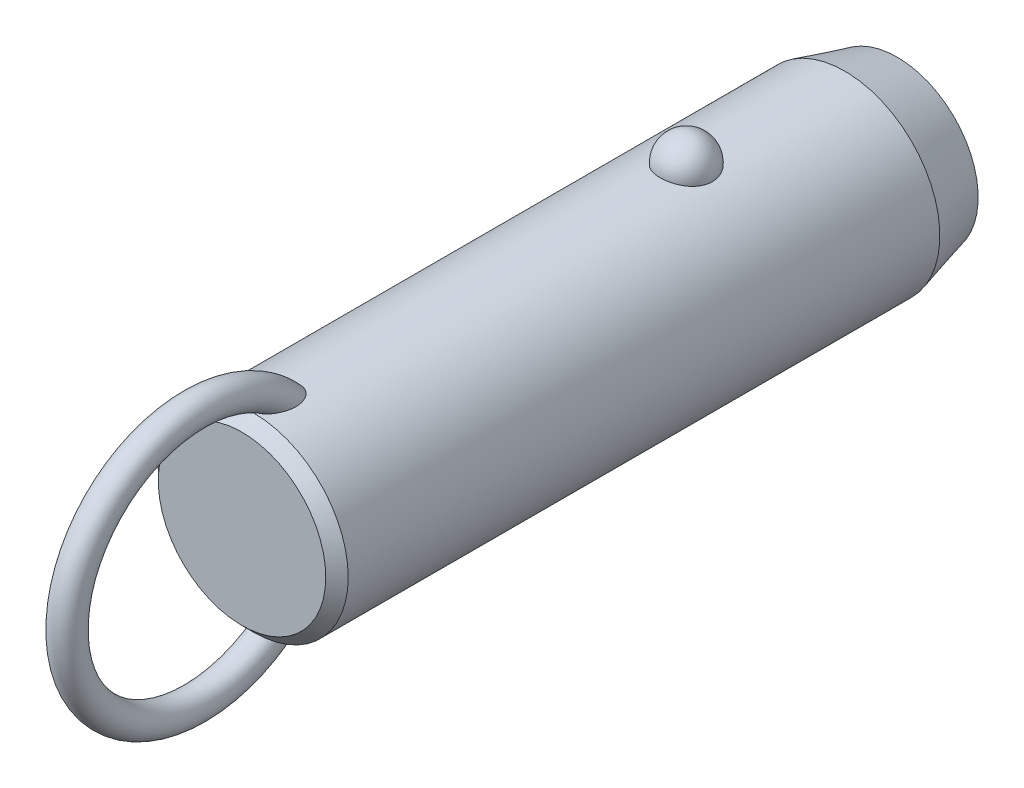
ISO-10303-21;
HEADER;
FILE_DESCRIPTION(('STEP AP214'),'2;1');
FILE_NAME('part.step','',(''),(''),'','','');
FILE_SCHEMA(('AUTOMOTIVE_DESIGN { 1 0 10303 214 1 1 1 1 }'));
ENDSEC;
DATA;
#1=APPLICATION_CONTEXT('core data for automotive mechanical design processes');
#2=APPLICATION_PROTOCOL_DEFINITION('international standard','automotive_design',2000,#1);
#3=PRODUCT_CONTEXT('',#1,'mechanical');
#4=PRODUCT('Part','Part','',(#3));
#5=PRODUCT_RELATED_PRODUCT_CATEGORY('part','',(#4));
#6=PRODUCT_DEFINITION_FORMATION('','',#4);
#7=PRODUCT_DEFINITION_CONTEXT('part definition',#1,'design');
#8=PRODUCT_DEFINITION('design','',#6,#7);
#9=PRODUCT_DEFINITION_SHAPE('','',#8);
#10=(LENGTH_UNIT() NAMED_UNIT(*) SI_UNIT(.MILLI.,.METRE.));
#11=(NAMED_UNIT(*) PLANE_ANGLE_UNIT() SI_UNIT($,.RADIAN.));
#12=(NAMED_UNIT(*) SI_UNIT($,.STERADIAN.) SOLID_ANGLE_UNIT());
#13=UNCERTAINTY_MEASURE_WITH_UNIT(LENGTH_MEASURE(1.E-05),#10,'distance_accuracy_value','');
#14=(GEOMETRIC_REPRESENTATION_CONTEXT(3) GLOBAL_UNCERTAINTY_ASSIGNED_CONTEXT((#13)) GLOBAL_UNIT_ASSIGNED_CONTEXT((#10,
#11,#12)) REPRESENTATION_CONTEXT('',''));
#15=CARTESIAN_POINT('',(0.,0.,0.));
#16=DIRECTION('',(0.,0.,1.));
#17=DIRECTION('',(1.,0.,0.));
#18=AXIS2_PLACEMENT_3D('',#15,#16,#17);
#19=CARTESIAN_POINT('',(0.,0.,43.2));
#20=DIRECTION('',(0.,0.,-1.));
#21=DIRECTION('',(-1.,0.,0.));
#22=AXIS2_PLACEMENT_3D('',#19,#20,#21);
#23=CYLINDRICAL_SURFACE('',#22,12.7);
#24=CARTESIAN_POINT('',(3.46661256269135,12.2177165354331,-3.5));
#25=CARTESIAN_POINT('',(3.4666090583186,12.2177194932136,-3.30432790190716));
#26=CARTESIAN_POINT('',(3.45063567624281,12.2222841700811,-3.10861112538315));
#27=CARTESIAN_POINT('',(3.38712451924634,12.2400345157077,-2.72271899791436));
#28=CARTESIAN_POINT('',(3.33957415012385,12.2532236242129,-2.53254588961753));
#29=CARTESIAN_POINT('',(3.2141234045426,12.286724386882,-2.16324948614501));
#30=CARTESIAN_POINT('',(3.13623639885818,12.3070329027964,-1.98412136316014));
#31=CARTESIAN_POINT('',(2.95205930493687,12.3525018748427,-1.64180592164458));
#32=CARTESIAN_POINT('',(2.84577003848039,12.3776621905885,-1.47861814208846));
#33=CARTESIAN_POINT('',(2.60688050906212,12.4301712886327,-1.17190583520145));
#34=CARTESIAN_POINT('',(2.47415697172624,12.4575299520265,-1.02847897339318));
#35=CARTESIAN_POINT('',(2.18615174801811,12.5112810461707,-0.766177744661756));
#36=CARTESIAN_POINT('',(2.03087002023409,12.5376734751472,-0.647303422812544));
#37=CARTESIAN_POINT('',(1.70237334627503,12.5864761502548,-0.437732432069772));
#38=CARTESIAN_POINT('',(1.52920948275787,12.6088972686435,-0.346958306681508));
#39=CARTESIAN_POINT('',(1.16944170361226,12.6473352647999,-0.195750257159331));
#40=CARTESIAN_POINT('',(0.982839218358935,12.663352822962,-0.135313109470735));
#41=CARTESIAN_POINT('',(0.604961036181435,12.6869706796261,-0.0473241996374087));
#42=CARTESIAN_POINT('',(0.413823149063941,12.6947125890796,-0.0192185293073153));
#43=CARTESIAN_POINT('',(0.0293827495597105,12.7014203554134,0.0051725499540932));
#44=CARTESIAN_POINT('',(-0.163919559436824,12.7003870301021,0.00146092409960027));
#45=CARTESIAN_POINT('',(-0.544374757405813,12.689735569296,-0.0373939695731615));
#46=CARTESIAN_POINT('',(-0.731575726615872,12.6802364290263,-0.0721015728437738));
#47=CARTESIAN_POINT('',(-1.09733277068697,12.6538333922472,-0.171364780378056));
#48=CARTESIAN_POINT('',(-1.27588869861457,12.6369293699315,-0.235920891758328));
#49=CARTESIAN_POINT('',(-1.6204698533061,12.5973946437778,-0.393548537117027));
#50=CARTESIAN_POINT('',(-1.78641865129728,12.5747321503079,-0.486778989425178));
#51=CARTESIAN_POINT('',(-2.10030671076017,12.5261316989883,-0.699110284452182));
#52=CARTESIAN_POINT('',(-2.24824419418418,12.5001934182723,-0.818213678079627));
#53=CARTESIAN_POINT('',(-2.52491489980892,12.4472906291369,-1.08157124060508));
#54=CARTESIAN_POINT('',(-2.65324222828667,12.4203160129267,-1.22624992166));
#55=CARTESIAN_POINT('',(-2.88410007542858,12.3687509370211,-1.53528325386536));
#56=CARTESIAN_POINT('',(-2.98662883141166,12.3441606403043,-1.69963924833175));
#57=CARTESIAN_POINT('',(-3.16432417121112,12.2998199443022,-2.04548497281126));
#58=CARTESIAN_POINT('',(-3.23917525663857,12.2801261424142,-2.22714424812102));
#59=CARTESIAN_POINT('',(-3.35800573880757,12.248167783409,-2.6009138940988));
#60=CARTESIAN_POINT('',(-3.4019860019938,12.2359030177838,-2.79302397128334));
#61=CARTESIAN_POINT('',(-3.45784812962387,12.2202347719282,-3.18140279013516));
#62=CARTESIAN_POINT('',(-3.46986123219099,12.2167950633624,-3.37765118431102));
#63=CARTESIAN_POINT('',(-3.46186273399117,12.2190638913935,-3.76943689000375));
#64=CARTESIAN_POINT('',(-3.44185196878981,12.2247721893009,-3.96497421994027));
#65=CARTESIAN_POINT('',(-3.37048652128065,12.2446381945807,-4.34881728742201));
#66=CARTESIAN_POINT('',(-3.31928253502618,12.2587552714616,-4.53715319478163));
#67=CARTESIAN_POINT('',(-3.18693461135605,12.2938237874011,-4.90231727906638));
#68=CARTESIAN_POINT('',(-3.1057895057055,12.3147754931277,-5.07914500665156));
#69=CARTESIAN_POINT('',(-2.91506431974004,12.3613125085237,-5.4173205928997));
#70=CARTESIAN_POINT('',(-2.80533587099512,12.3869217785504,-5.57858147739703));
#71=CARTESIAN_POINT('',(-2.560414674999,12.4398525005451,-5.88013283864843));
#72=CARTESIAN_POINT('',(-2.42522099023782,12.4671740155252,-6.02042254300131));
#73=CARTESIAN_POINT('',(-2.1323357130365,12.5205965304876,-6.27662798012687));
#74=CARTESIAN_POINT('',(-1.97456596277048,12.5466928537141,-6.39245542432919));
#75=CARTESIAN_POINT('',(-1.64115839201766,12.5946384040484,-6.59583547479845));
#76=CARTESIAN_POINT('',(-1.46552179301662,12.6164879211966,-6.68339001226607));
#77=CARTESIAN_POINT('',(-1.10356050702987,12.6532533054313,-6.82682153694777));
#78=CARTESIAN_POINT('',(-0.917391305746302,12.6682500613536,-6.88306988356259));
#79=CARTESIAN_POINT('',(-0.537836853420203,12.6900288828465,-6.96386887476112));
#80=CARTESIAN_POINT('',(-0.344452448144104,12.6968119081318,-6.98842322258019));
#81=CARTESIAN_POINT('',(0.0402577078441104,12.7013667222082,-7.0049646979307));
#82=CARTESIAN_POINT('',(0.231556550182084,12.6993008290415,-6.99753844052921));
#83=CARTESIAN_POINT('',(0.610105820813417,12.6867505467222,-6.95166366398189));
#84=CARTESIAN_POINT('',(0.797356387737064,12.6762664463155,-6.91321620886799));
#85=CARTESIAN_POINT('',(1.16186657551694,12.6480587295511,-6.80658431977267));
#86=CARTESIAN_POINT('',(1.33915951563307,12.6303611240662,-6.73850666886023));
#87=CARTESIAN_POINT('',(1.67968518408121,12.5896027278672,-6.57450875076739));
#88=CARTESIAN_POINT('',(1.84291705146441,12.5665416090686,-6.47858678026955));
#89=CARTESIAN_POINT('',(2.15340192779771,12.5171072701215,-6.25982455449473));
#90=CARTESIAN_POINT('',(2.30037831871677,12.4906895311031,-6.13660186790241));
#91=CARTESIAN_POINT('',(2.5717412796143,12.4376567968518,-5.86739587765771));
#92=CARTESIAN_POINT('',(2.69612388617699,12.4110417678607,-5.72140858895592));
#93=CARTESIAN_POINT('',(2.92107785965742,12.360051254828,-5.40794137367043));
#94=CARTESIAN_POINT('',(3.02121329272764,12.3357209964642,-5.24014110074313));
#95=CARTESIAN_POINT('',(3.19236291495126,12.2925446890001,-4.8896986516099));
#96=CARTESIAN_POINT('',(3.26338839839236,12.2736965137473,-4.70706226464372));
#97=CARTESIAN_POINT('',(3.36788038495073,12.245404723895,-4.35469510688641));
#98=CARTESIAN_POINT('',(3.40484026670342,12.2351018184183,-4.18605935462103));
#99=CARTESIAN_POINT('',(3.45420764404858,12.2212564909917,-3.84496058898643));
#100=CARTESIAN_POINT('',(3.46661565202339,12.2177139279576,-3.67249765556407));
#101=CARTESIAN_POINT('',(3.46661256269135,12.2177165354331,-3.5));
#102=B_SPLINE_CURVE_WITH_KNOTS('',3,(#24,#25,#26,#27,#28,#29,#30,#31,#32,#33,#34,#35,#36,#37,
#38,#39,#40,#41,#42,#43,#44,#45,#46,#47,#48,#49,#50,#51,#52,#53,#54,#55,#56,#57,#58,#59,#60,#61,
#62,#63,#64,#65,#66,#67,#68,#69,#70,#71,#72,#73,#74,#75,#76,#77,#78,#79,#80,#81,#82,#83,#84,#85,
#86,#87,#88,#89,#90,#91,#92,#93,#94,#95,#96,#97,#98,#99,#100,#101),.UNSPECIFIED.,.T.,.F.,(4,2,2,
2,2,2,2,2,2,2,2,2,2,2,2,2,2,2,2,2,2,2,2,2,2,2,2,2,2,2,2,2,2,2,2,2,2,2,4),(0.,0.586396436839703,
1.17302689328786,1.7593990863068,2.34575431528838,2.93491084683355,3.52406845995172,
4.11158733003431,4.69904375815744,5.2762784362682,5.85345931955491,6.42265312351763,
6.99185659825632,7.56427334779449,8.136746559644,8.71981013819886,9.3029135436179,
9.89247258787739,10.4820150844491,11.0691335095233,11.6562366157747,12.2405256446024,
12.8248374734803,13.412244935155,13.9996740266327,14.5891883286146,15.1786623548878,
15.7609861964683,16.3432419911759,16.914863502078,17.4864654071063,18.0560241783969,
18.6256177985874,19.2037609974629,19.7820055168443,20.3699810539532,20.9577282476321,
21.4746855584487,21.9916320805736),.UNSPECIFIED.);
#103=CARTESIAN_POINT('',(3.46661256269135,12.2177165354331,-3.5));
#104=VERTEX_POINT('',#103);
#105=EDGE_CURVE('E41',#104,#104,#102,.T.);
#106=ORIENTED_EDGE('',*,*,#105,.T.);
#107=EDGE_LOOP('',(#106));
#108=FACE_BOUND('',#107,.T.);
#109=CARTESIAN_POINT('',(0.,0.,54.4));
#110=DIRECTION('',(0.,0.,1.));
#111=DIRECTION('',(1.,0.,0.));
#112=AXIS2_PLACEMENT_3D('',#109,#110,#111);
#113=CIRCLE('',#112,12.7);
#114=CARTESIAN_POINT('',(12.7,0.,54.4));
#115=VERTEX_POINT('',#114);
#116=EDGE_CURVE('E10',#115,#115,#113,.F.);
#117=ORIENTED_EDGE('',*,*,#116,.T.);
#118=EDGE_LOOP('',(#117));
#119=FACE_BOUND('',#118,.T.);
#120=CARTESIAN_POINT('',(-0.548122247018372,-12.6881662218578,48.1432187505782));
#121=CARTESIAN_POINT('',(-0.648865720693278,-12.6838128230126,48.177926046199));
#122=CARTESIAN_POINT('',(-0.746398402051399,-12.6783867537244,48.2220428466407));
#123=CARTESIAN_POINT('',(-0.932125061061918,-12.666091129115,48.3267647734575));
#124=CARTESIAN_POINT('',(-1.02030388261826,-12.6592192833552,48.387396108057));
#125=CARTESIAN_POINT('',(-1.18487740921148,-12.6448747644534,48.521847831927));
#126=CARTESIAN_POINT('',(-1.26134296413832,-12.637406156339,48.5955825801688));
#127=CARTESIAN_POINT('',(-1.4023120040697,-12.6225412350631,48.7536045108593));
#128=CARTESIAN_POINT('',(-1.46681470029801,-12.6151449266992,48.8378923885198));
#129=CARTESIAN_POINT('',(-1.60714786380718,-12.5981718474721,49.0496577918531));
#130=CARTESIAN_POINT('',(-1.67725126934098,-12.588900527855,49.180962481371));
#131=CARTESIAN_POINT('',(-1.79536591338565,-12.5725964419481,49.4532471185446));
#132=CARTESIAN_POINT('',(-1.84333535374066,-12.5655679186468,49.5942447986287));
#133=CARTESIAN_POINT('',(-1.93422576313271,-12.5519624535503,49.9376455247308));
#134=CARTESIAN_POINT('',(-1.96788773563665,-12.5466298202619,50.1425578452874));
#135=CARTESIAN_POINT('',(-1.9941399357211,-12.542463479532,50.4517600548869));
#136=CARTESIAN_POINT('',(-1.99883864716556,-12.5417153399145,50.5552987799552));
#137=CARTESIAN_POINT('',(-2.00078003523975,-12.5414074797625,50.7624512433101));
#138=CARTESIAN_POINT('',(-1.99802449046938,-12.5418474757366,50.8660649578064));
#139=CARTESIAN_POINT('',(-1.98336733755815,-12.5441750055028,51.1103207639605));
#140=CARTESIAN_POINT('',(-1.96851430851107,-12.5465291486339,51.2507804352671));
#141=CARTESIAN_POINT('',(-1.92707089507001,-12.5529612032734,51.5299607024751));
#142=CARTESIAN_POINT('',(-1.90047458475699,-12.5570399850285,51.6686803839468));
#143=CARTESIAN_POINT('',(-1.83619120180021,-12.5666008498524,51.9434113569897));
#144=CARTESIAN_POINT('',(-1.79850828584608,-12.57208240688,52.0794236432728));
#145=CARTESIAN_POINT('',(-1.71223796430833,-12.5841228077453,52.3478421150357));
#146=CARTESIAN_POINT('',(-1.66365679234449,-12.5906810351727,52.4802503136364));
#147=CARTESIAN_POINT('',(-1.57804503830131,-12.6016176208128,52.6854887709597));
#148=CARTESIAN_POINT('',(-1.54477252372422,-12.6057501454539,52.7599149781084));
#149=CARTESIAN_POINT('',(-1.47424480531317,-12.6141930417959,52.9068393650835));
#150=CARTESIAN_POINT('',(-1.43699041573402,-12.6185033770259,52.9793379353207));
#151=CARTESIAN_POINT('',(-1.35825795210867,-12.6272207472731,53.1218926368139));
#152=CARTESIAN_POINT('',(-1.31678520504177,-12.6316276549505,53.1919517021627));
#153=CARTESIAN_POINT('',(-1.22917793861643,-12.6404532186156,53.3290705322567));
#154=CARTESIAN_POINT('',(-1.18304514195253,-12.6448718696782,53.3961313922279));
#155=CARTESIAN_POINT('',(-1.0724641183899,-12.6547893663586,53.5438741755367));
#156=CARTESIAN_POINT('',(-1.00642239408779,-12.6602600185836,53.6233844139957));
#157=CARTESIAN_POINT('',(-0.86444142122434,-12.6707460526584,53.7731698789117));
#158=CARTESIAN_POINT('',(-0.788516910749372,-12.6757620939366,53.8434585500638));
#159=CARTESIAN_POINT('',(-0.652215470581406,-12.6833591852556,53.9486801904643));
#160=CARTESIAN_POINT('',(-0.594982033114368,-12.6861973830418,53.9876241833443));
#161=CARTESIAN_POINT('',(-0.475269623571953,-12.6912445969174,54.0564899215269));
#162=CARTESIAN_POINT('',(-0.412800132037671,-12.6934547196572,54.0864275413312));
#163=CARTESIAN_POINT('',(-0.29574972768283,-12.6966636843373,54.1297565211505));
#164=CARTESIAN_POINT('',(-0.241949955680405,-12.6978134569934,54.1452188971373));
#165=CARTESIAN_POINT('',(-0.132508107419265,-12.6994261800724,54.1668845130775));
#166=CARTESIAN_POINT('',(-0.0768679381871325,-12.6998898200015,54.1730970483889));
#167=CARTESIAN_POINT('',(0.0347696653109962,-12.7000752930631,54.1755838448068));
#168=CARTESIAN_POINT('',(0.0907676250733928,-12.6997954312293,54.1718353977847));
#169=CARTESIAN_POINT('',(0.201283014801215,-12.6985255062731,54.1547883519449));
#170=CARTESIAN_POINT('',(0.255799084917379,-12.6975348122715,54.1414812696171));
#171=CARTESIAN_POINT('',(0.376042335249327,-12.6946091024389,54.1020379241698));
#172=CARTESIAN_POINT('',(0.440950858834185,-12.6924943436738,54.0734492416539));
#173=CARTESIAN_POINT('',(0.565350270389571,-12.6875639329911,54.0063234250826));
#174=CARTESIAN_POINT('',(0.624828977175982,-12.6847467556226,53.9677646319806));
#175=CARTESIAN_POINT('',(0.774116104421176,-12.6767252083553,53.856949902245));
#176=CARTESIAN_POINT('',(0.859449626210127,-12.6711344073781,53.7787605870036));
#177=CARTESIAN_POINT('',(1.01789440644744,-12.6593922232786,53.610943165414));
#178=CARTESIAN_POINT('',(1.09096902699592,-12.653239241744,53.521282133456));
#179=CARTESIAN_POINT('',(1.22268793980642,-12.6411674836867,53.3402658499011));
#180=CARTESIAN_POINT('',(1.28193986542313,-12.6352572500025,53.249345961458));
#181=CARTESIAN_POINT('',(1.39259777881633,-12.6235401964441,53.0627929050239));
#182=CARTESIAN_POINT('',(1.44399707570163,-12.6177334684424,52.9671558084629));
#183=CARTESIAN_POINT('',(1.53972870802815,-12.6064093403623,52.7722738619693));
#184=CARTESIAN_POINT('',(1.58405262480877,-12.6008922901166,52.6730248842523));
#185=CARTESIAN_POINT('',(1.66600705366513,-12.5903187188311,52.4717727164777));
#186=CARTESIAN_POINT('',(1.70363651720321,-12.5852622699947,52.3697690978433));
#187=CARTESIAN_POINT('',(1.77545379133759,-12.5753406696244,52.1543580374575));
#188=CARTESIAN_POINT('',(1.80903453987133,-12.5705328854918,52.040745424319));
#189=CARTESIAN_POINT('',(1.86844163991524,-12.5618400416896,51.8114575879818));
#190=CARTESIAN_POINT('',(1.89426665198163,-12.5579551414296,51.6957820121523));
#191=CARTESIAN_POINT('',(1.9378546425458,-12.5513030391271,51.4630072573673));
#192=CARTESIAN_POINT('',(1.9556264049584,-12.5485346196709,51.3459097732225));
#193=CARTESIAN_POINT('',(1.98264463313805,-12.5442934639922,51.1107473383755));
#194=CARTESIAN_POINT('',(1.99189298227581,-12.5428204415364,50.9926826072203));
#195=CARTESIAN_POINT('',(2.00416068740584,-12.540871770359,50.6806225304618));
#196=CARTESIAN_POINT('',(1.99944433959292,-12.541631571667,50.4862290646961));
#197=CARTESIAN_POINT('',(1.96113755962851,-12.5476846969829,50.1003095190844));
#198=CARTESIAN_POINT('',(1.92758341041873,-12.5529723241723,49.9087801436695));
#199=CARTESIAN_POINT('',(1.8393434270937,-12.5661532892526,49.5822728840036));
#200=CARTESIAN_POINT('',(1.79215440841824,-12.5730485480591,49.4452499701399));
#201=CARTESIAN_POINT('',(1.67676242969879,-12.588958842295,49.1804459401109));
#202=CARTESIAN_POINT('',(1.60859050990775,-12.597970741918,49.0526515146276));
#203=CARTESIAN_POINT('',(1.46583832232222,-12.6152829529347,48.8358006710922));
#204=CARTESIAN_POINT('',(1.39525727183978,-12.6233659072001,48.7441050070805));
#205=CARTESIAN_POINT('',(1.23992594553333,-12.6395676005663,48.5734854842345));
#206=CARTESIAN_POINT('',(1.15517932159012,-12.6476863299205,48.4945583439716));
#207=CARTESIAN_POINT('',(0.971995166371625,-12.6630846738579,48.3526438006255));
#208=CARTESIAN_POINT('',(0.873456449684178,-12.6703572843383,48.2897849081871));
#209=CARTESIAN_POINT('',(0.665847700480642,-12.6829569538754,48.1844870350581));
#210=CARTESIAN_POINT('',(0.556784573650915,-12.688285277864,48.1420347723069));
#211=CARTESIAN_POINT('',(0.347338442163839,-12.6956226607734,48.0844434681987));
#212=CARTESIAN_POINT('',(0.247759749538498,-12.6979816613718,48.0663996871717));
#213=CARTESIAN_POINT('',(0.0470218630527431,-12.7003077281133,48.0486007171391));
#214=CARTESIAN_POINT('',(-0.0541350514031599,-12.7002779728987,48.0488212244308));
#215=CARTESIAN_POINT('',(-0.221414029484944,-12.6982482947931,48.0643639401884));
#216=CARTESIAN_POINT('',(-0.288055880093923,-12.6969033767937,48.0746662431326));
#217=CARTESIAN_POINT('',(-0.419599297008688,-12.6932369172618,48.1031348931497));
#218=CARTESIAN_POINT('',(-0.484501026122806,-12.6909154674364,48.1213005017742));
#219=CARTESIAN_POINT('',(-0.548122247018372,-12.6881662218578,48.1432187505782));
#220=B_SPLINE_CURVE_WITH_KNOTS('',3,(#120,#121,#122,#123,#124,#125,#126,#127,#128,#129,#130,
#131,#132,#133,#134,#135,#136,#137,#138,#139,#140,#141,#142,#143,#144,#145,#146,#147,#148,#149,
#150,#151,#152,#153,#154,#155,#156,#157,#158,#159,#160,#161,#162,#163,#164,#165,#166,#167,#168,
#169,#170,#171,#172,#173,#174,#175,#176,#177,#178,#179,#180,#181,#182,#183,#184,#185,#186,#187,
#188,#189,#190,#191,#192,#193,#194,#195,#196,#197,#198,#199,#200,#201,#202,#203,#204,#205,#206,
#207,#208,#209,#210,#211,#212,#213,#214,#215,#216,#217,#218,#219),.UNSPECIFIED.,.T.,.F.,(4,2,2,
2,2,2,2,2,2,2,2,2,2,2,2,2,2,2,2,2,2,2,2,2,2,2,2,2,2,2,2,2,2,2,2,2,2,2,2,2,2,2,2,2,2,2,2,2,2,4),
(0.,0.319642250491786,0.63979475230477,0.957927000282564,1.27608021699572,1.72100165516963,
2.16675988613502,2.78630021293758,3.09705782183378,3.40774128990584,3.83096358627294,
4.2543996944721,4.67767724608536,5.10071330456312,5.34550297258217,5.59024267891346,
5.83467707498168,6.07902143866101,6.38891080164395,6.69834321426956,6.90560910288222,
7.11250749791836,7.27977315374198,7.44687060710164,7.61434932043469,7.78197685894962,
7.99365544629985,8.20579780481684,8.55147335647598,8.8981642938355,9.22375138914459,
9.54961437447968,9.87586224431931,10.202161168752,10.557587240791,10.9130746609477,
11.2681734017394,11.6231936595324,12.2046601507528,12.7853961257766,13.219164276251,
13.6522938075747,13.9989174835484,14.3454519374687,14.6946768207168,15.0436740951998,
15.3457513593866,15.6474266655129,15.8493051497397,16.0511646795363),.UNSPECIFIED.);
#221=CARTESIAN_POINT('',(-0.548122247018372,-12.6881662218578,48.1432187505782));
#222=VERTEX_POINT('',#221);
#223=EDGE_CURVE('E60',#222,#222,#220,.T.);
#224=ORIENTED_EDGE('',*,*,#223,.T.);
#225=EDGE_LOOP('',(#224));
#226=FACE_BOUND('',#225,.T.);
#227=CARTESIAN_POINT('',(-0.548122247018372,12.6881662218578,48.1432187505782));
#228=CARTESIAN_POINT('',(-0.459436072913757,12.6919968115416,48.112673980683));
#229=CARTESIAN_POINT('',(-0.368189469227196,12.6949996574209,48.0893913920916));
#230=CARTESIAN_POINT('',(-0.183024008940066,12.6990186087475,48.0584062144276));
#231=CARTESIAN_POINT('',(-0.089104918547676,12.7000345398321,48.0507049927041));
#232=CARTESIAN_POINT('',(0.0987147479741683,12.6999636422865,48.0512455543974));
#233=CARTESIAN_POINT('',(0.192615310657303,12.6988761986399,48.0594920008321));
#234=CARTESIAN_POINT('',(0.377658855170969,12.6947211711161,48.0915515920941));
#235=CARTESIAN_POINT('',(0.46880177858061,12.6916535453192,48.1153650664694));
#236=CARTESIAN_POINT('',(0.645809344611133,12.6838788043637,48.1774565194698));
#237=CARTESIAN_POINT('',(0.731679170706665,12.6791733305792,48.215720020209));
#238=CARTESIAN_POINT('',(0.896315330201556,12.6686004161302,48.305120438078));
#239=CARTESIAN_POINT('',(0.975080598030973,12.6627328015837,48.3562592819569));
#240=CARTESIAN_POINT('',(1.12963655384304,12.6499161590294,48.4736782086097));
#241=CARTESIAN_POINT('',(1.20478673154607,12.6429194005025,48.5407929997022));
#242=CARTESIAN_POINT('',(1.34448241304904,12.6288282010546,48.6852250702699));
#243=CARTESIAN_POINT('',(1.40902173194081,12.621733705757,48.7625482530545));
#244=CARTESIAN_POINT('',(1.55208211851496,12.6050877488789,48.9592475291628));
#245=CARTESIAN_POINT('',(1.62510490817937,12.5957546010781,49.0826540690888));
#246=CARTESIAN_POINT('',(1.7501904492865,12.5789823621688,49.3397690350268));
#247=CARTESIAN_POINT('',(1.80221377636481,12.5715468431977,49.473496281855));
#248=CARTESIAN_POINT('',(1.90309965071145,12.5567434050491,49.7983516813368));
#249=CARTESIAN_POINT('',(1.94342317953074,12.5504515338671,49.9921611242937));
#250=CARTESIAN_POINT('',(1.99332997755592,12.5426147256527,50.3837881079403));
#251=CARTESIAN_POINT('',(2.00285305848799,12.5410790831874,50.5816127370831));
#252=CARTESIAN_POINT('',(1.99678999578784,12.5420407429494,50.9166427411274));
#253=CARTESIAN_POINT('',(1.98794117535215,12.5434564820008,51.0540428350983));
#254=CARTESIAN_POINT('',(1.95865119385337,12.5480641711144,51.3276394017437));
#255=CARTESIAN_POINT('',(1.93820436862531,12.5512569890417,51.4638352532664));
#256=CARTESIAN_POINT('',(1.88647896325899,12.5591352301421,51.7342493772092));
#257=CARTESIAN_POINT('',(1.85518800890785,12.5638223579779,51.8684652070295));
#258=CARTESIAN_POINT('',(1.78217886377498,12.5743868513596,52.1339362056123));
#259=CARTESIAN_POINT('',(1.74046509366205,12.5802637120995,52.2651926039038));
#260=CARTESIAN_POINT('',(1.66024095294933,12.5910571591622,52.4860855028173));
#261=CARTESIAN_POINT('',(1.62434772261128,12.5957535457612,52.5766904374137));
#262=CARTESIAN_POINT('',(1.54709009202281,12.6054762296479,52.7555125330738));
#263=CARTESIAN_POINT('',(1.50572681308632,12.6105024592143,52.8437301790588));
#264=CARTESIAN_POINT('',(1.41728020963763,12.620748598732,53.0169321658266));
#265=CARTESIAN_POINT('',(1.37021377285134,12.625967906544,53.1019251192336));
#266=CARTESIAN_POINT('',(1.26969620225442,12.6364721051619,53.2680072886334));
#267=CARTESIAN_POINT('',(1.21624929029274,12.6417569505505,53.3490990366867));
#268=CARTESIAN_POINT('',(1.10304413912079,12.6521331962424,53.5047027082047));
#269=CARTESIAN_POINT('',(1.04340936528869,12.657226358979,53.5793033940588));
#270=CARTESIAN_POINT('',(0.915919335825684,12.6670906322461,53.721324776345));
#271=CARTESIAN_POINT('',(0.848064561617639,12.6718617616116,53.7887458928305));
#272=CARTESIAN_POINT('',(0.717035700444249,12.67987711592,53.9006247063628));
#273=CARTESIAN_POINT('',(0.655526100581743,12.6832377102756,53.9469970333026));
#274=CARTESIAN_POINT('',(0.525985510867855,12.6892676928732,54.0296195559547));
#275=CARTESIAN_POINT('',(0.457969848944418,12.6919386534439,54.0658927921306));
#276=CARTESIAN_POINT('',(0.334859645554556,12.695691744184,54.1166572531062));
#277=CARTESIAN_POINT('',(0.281116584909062,12.6970073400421,54.1343733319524));
#278=CARTESIAN_POINT('',(0.171425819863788,12.6989609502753,54.1606429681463));
#279=CARTESIAN_POINT('',(0.115480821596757,12.699599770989,54.1692074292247));
#280=CARTESIAN_POINT('',(0.00272618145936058,12.7001251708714,54.1762531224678));
#281=CARTESIAN_POINT('',(-0.0540859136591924,12.7000089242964,54.1746964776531));
#282=CARTESIAN_POINT('',(-0.166544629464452,12.6990328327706,54.1616005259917));
#283=CARTESIAN_POINT('',(-0.222190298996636,12.6981724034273,54.1500533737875));
#284=CARTESIAN_POINT('',(-0.342018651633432,12.695562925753,54.1149128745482));
#285=CARTESIAN_POINT('',(-0.405606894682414,12.6936676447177,54.0893322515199));
#286=CARTESIAN_POINT('',(-0.527815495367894,12.6891754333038,54.0283111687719));
#287=CARTESIAN_POINT('',(-0.586425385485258,12.6865770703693,53.9928505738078));
#288=CARTESIAN_POINT('',(-0.731842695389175,12.6792129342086,53.8914960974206));
#289=CARTESIAN_POINT('',(-0.814709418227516,12.6740767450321,53.8200395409));
#290=CARTESIAN_POINT('',(-0.969101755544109,12.6632083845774,53.6658900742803));
#291=CARTESIAN_POINT('',(-1.04059564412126,12.6574746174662,53.5831668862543));
#292=CARTESIAN_POINT('',(-1.1698111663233,12.6461638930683,53.4158096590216));
#293=CARTESIAN_POINT('',(-1.22811369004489,12.6405994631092,53.3316166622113));
#294=CARTESIAN_POINT('',(-1.33743405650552,12.6295007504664,53.1585791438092));
#295=CARTESIAN_POINT('',(-1.38844577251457,12.6239664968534,53.0697307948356));
#296=CARTESIAN_POINT('',(-1.48400702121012,12.6130898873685,52.888389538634));
#297=CARTESIAN_POINT('',(-1.52854232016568,12.6077479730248,52.7958891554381));
#298=CARTESIAN_POINT('',(-1.61150113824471,12.5974127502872,52.6081607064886));
#299=CARTESIAN_POINT('',(-1.64992317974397,12.5924195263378,52.5129319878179));
#300=CARTESIAN_POINT('',(-1.73468589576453,12.581070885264,52.2828936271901));
#301=CARTESIAN_POINT('',(-1.77831261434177,12.5749388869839,52.1470661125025));
#302=CARTESIAN_POINT('',(-1.85439734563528,12.5639437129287,51.8722128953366));
#303=CARTESIAN_POINT('',(-1.88684994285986,12.5590811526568,51.7331856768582));
#304=CARTESIAN_POINT('',(-1.9400848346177,12.550968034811,51.4530923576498));
#305=CARTESIAN_POINT('',(-1.96088706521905,12.5477147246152,51.3120301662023));
#306=CARTESIAN_POINT('',(-1.99000539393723,12.5431291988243,51.0286689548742));
#307=CARTESIAN_POINT('',(-1.99832911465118,12.5417958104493,50.8863707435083));
#308=CARTESIAN_POINT('',(-2.00166624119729,12.5412674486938,50.5576271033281));
#309=CARTESIAN_POINT('',(-1.99178843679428,12.5428579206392,50.371088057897));
#310=CARTESIAN_POINT('',(-1.9445518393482,12.5502731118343,50.0016240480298));
#311=CARTESIAN_POINT('',(-1.90724032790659,12.5560905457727,49.8186934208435));
#312=CARTESIAN_POINT('',(-1.81330718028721,12.5699462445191,49.5048488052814));
#313=CARTESIAN_POINT('',(-1.76338820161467,12.5771273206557,49.3719105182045));
#314=CARTESIAN_POINT('',(-1.64305018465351,12.593414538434,49.1156813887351));
#315=CARTESIAN_POINT('',(-1.57265346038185,12.6025185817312,48.992380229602));
#316=CARTESIAN_POINT('',(-1.42634956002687,12.6198178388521,48.7835648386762));
#317=CARTESIAN_POINT('',(-1.35423772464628,12.6278405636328,48.6953846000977));
#318=CARTESIAN_POINT('',(-1.19645664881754,12.6437632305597,48.5321079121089));
#319=CARTESIAN_POINT('',(-1.11080536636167,12.6516633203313,48.4569944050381));
#320=CARTESIAN_POINT('',(-0.947219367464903,12.6648319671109,48.3378114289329));
#321=CARTESIAN_POINT('',(-0.871624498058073,12.670300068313,48.2905414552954));
#322=CARTESIAN_POINT('',(-0.714161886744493,12.6801492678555,48.2077413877));
#323=CARTESIAN_POINT('',(-0.632295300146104,12.684530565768,48.1722091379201));
#324=CARTESIAN_POINT('',(-0.548122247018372,12.6881662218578,48.1432187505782));
#325=B_SPLINE_CURVE_WITH_KNOTS('',3,(#227,#228,#229,#230,#231,#232,#233,#234,#235,#236,#237,
#238,#239,#240,#241,#242,#243,#244,#245,#246,#247,#248,#249,#250,#251,#252,#253,#254,#255,#256,
#257,#258,#259,#260,#261,#262,#263,#264,#265,#266,#267,#268,#269,#270,#271,#272,#273,#274,#275,
#276,#277,#278,#279,#280,#281,#282,#283,#284,#285,#286,#287,#288,#289,#290,#291,#292,#293,#294,
#295,#296,#297,#298,#299,#300,#301,#302,#303,#304,#305,#306,#307,#308,#309,#310,#311,#312,#313,
#314,#315,#316,#317,#318,#319,#320,#321,#322,#323,#324),.UNSPECIFIED.,.T.,.F.,(4,2,2,2,2,2,2,2,
2,2,2,2,2,2,2,2,2,2,2,2,2,2,2,2,2,2,2,2,2,2,2,2,2,2,2,2,2,2,2,2,2,2,2,2,2,2,2,2,4),(0.,
0.281328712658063,0.56268211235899,0.844117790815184,1.12555942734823,1.40671982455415,
1.68792232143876,1.98972294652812,2.2916988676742,2.72039860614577,3.14989948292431,
3.74084916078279,4.3329529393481,4.74554109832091,5.15833092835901,5.57159335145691,
5.98468079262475,6.27722775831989,6.56971484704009,6.86135609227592,7.15280542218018,
7.43927407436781,7.7257259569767,7.9563586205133,8.18646071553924,8.35559393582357,
8.52452541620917,8.69408946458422,8.86378678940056,9.06834348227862,9.27332014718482,
9.60010414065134,9.92778432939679,10.2350252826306,10.5425229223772,10.8506864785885,
11.1589244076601,11.5867893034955,12.0148612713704,12.4421984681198,12.8692745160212,
13.4279365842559,13.9856380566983,14.4107062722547,14.8353130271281,15.1765567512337,
15.5173516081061,15.7844129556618,16.051425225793),.UNSPECIFIED.);
#326=CARTESIAN_POINT('',(-0.548122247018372,12.6881662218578,48.1432187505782));
#327=VERTEX_POINT('',#326);
#328=EDGE_CURVE('E68',#327,#327,#325,.T.);
#329=ORIENTED_EDGE('',*,*,#328,.T.);
#330=EDGE_LOOP('',(#329));
#331=FACE_BOUND('',#330,.T.);
#332=CARTESIAN_POINT('',(0.,0.,-24.7000000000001));
#333=DIRECTION('',(0.,0.,-1.));
#334=DIRECTION('',(-1.,0.,0.));
#335=AXIS2_PLACEMENT_3D('',#332,#333,#334);
#336=CIRCLE('',#335,12.7);
#337=CARTESIAN_POINT('',(-12.7,0.,-24.7000000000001));
#338=VERTEX_POINT('',#337);
#339=EDGE_CURVE('E57',#338,#338,#336,.F.);
#340=ORIENTED_EDGE('',*,*,#339,.T.);
#341=EDGE_LOOP('',(#340));
#342=FACE_BOUND('',#341,.T.);
#343=ADVANCED_FACE('F37',(#108,#119,#226,#331,#342),#23,.T.);
#344=CARTESIAN_POINT('',(0.,0.,-31.7));
#345=DIRECTION('',(0.,0.,-1.));
#346=DIRECTION('',(-1.,0.,0.));
#347=AXIS2_PLACEMENT_3D('',#344,#345,#346);
#348=PLANE('',#347);
#349=CARTESIAN_POINT('',(0.,0.,-31.7));
#350=DIRECTION('',(0.,0.,-1.));
#351=DIRECTION('',(-1.,0.,0.));
#352=AXIS2_PLACEMENT_3D('',#349,#350,#351);
#353=CIRCLE('',#352,10.8243556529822);
#354=CARTESIAN_POINT('',(-10.8243556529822,0.,-31.7));
#355=VERTEX_POINT('',#354);
#356=EDGE_CURVE('E67',#355,#355,#353,.T.);
#357=ORIENTED_EDGE('',*,*,#356,.T.);
#358=EDGE_LOOP('',(#357));
#359=FACE_BOUND('',#358,.T.);
#360=ADVANCED_FACE('F86',(#359),#348,.T.);
#361=CARTESIAN_POINT('',(0.,0.,-31.7));
#362=DIRECTION('',(0.,0.,1.));
#363=DIRECTION('',(1.,0.,0.));
#364=AXIS2_PLACEMENT_3D('',#361,#362,#363);
#365=CONICAL_SURFACE('',#364,10.8243556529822,0.261799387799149);
#366=ORIENTED_EDGE('',*,*,#339,.F.);
#367=EDGE_LOOP('',(#366));
#368=FACE_BOUND('',#367,.T.);
#369=ORIENTED_EDGE('',*,*,#356,.F.);
#370=EDGE_LOOP('',(#369));
#371=FACE_BOUND('',#370,.T.);
#372=ADVANCED_FACE('F84',(#368,#371),#365,.T.);
#373=CARTESIAN_POINT('',(0.,0.,55.9));
#374=DIRECTION('',(0.,0.,1.));
#375=DIRECTION('',(1.,0.,0.));
#376=AXIS2_PLACEMENT_3D('',#373,#374,#375);
#377=PLANE('',#376);
#378=CARTESIAN_POINT('',(0.,0.,55.9));
#379=DIRECTION('',(0.,0.,1.));
#380=DIRECTION('',(1.,0.,0.));
#381=AXIS2_PLACEMENT_3D('',#378,#379,#380);
#382=CIRCLE('',#381,11.2);
#383=CARTESIAN_POINT('',(11.2,0.,55.9));
#384=VERTEX_POINT('',#383);
#385=EDGE_CURVE('E50',#384,#384,#382,.T.);
#386=ORIENTED_EDGE('',*,*,#385,.T.);
#387=EDGE_LOOP('',(#386));
#388=FACE_BOUND('',#387,.T.);
#389=ADVANCED_FACE('F78',(#388),#377,.T.);
#390=CARTESIAN_POINT('',(0.,0.,62.25));
#391=DIRECTION('',(1.,0.,0.));
#392=DIRECTION('',(0.,0.,-1.));
#393=AXIS2_PLACEMENT_3D('',#390,#391,#392);
#394=TOROIDAL_SURFACE('',#393,17.05,2.);
#395=ORIENTED_EDGE('',*,*,#328,.F.);
#396=EDGE_LOOP('',(#395));
#397=FACE_BOUND('',#396,.T.);
#398=ORIENTED_EDGE('',*,*,#223,.F.);
#399=EDGE_LOOP('',(#398));
#400=FACE_BOUND('',#399,.T.);
#401=ADVANCED_FACE('F74',(#397,#400),#394,.T.);
#402=CARTESIAN_POINT('',(0.,0.,55.9));
#403=DIRECTION('',(0.,0.,-1.));
#404=DIRECTION('',(-1.,0.,0.));
#405=AXIS2_PLACEMENT_3D('',#402,#403,#404);
#406=CONICAL_SURFACE('',#405,11.2,0.785398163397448);
#407=ORIENTED_EDGE('',*,*,#116,.F.);
#408=EDGE_LOOP('',(#407));
#409=FACE_BOUND('',#408,.T.);
#410=ORIENTED_EDGE('',*,*,#385,.F.);
#411=EDGE_LOOP('',(#410));
#412=FACE_BOUND('',#411,.T.);
#413=ADVANCED_FACE('F39',(#409,#412),#406,.T.);
#414=CARTESIAN_POINT('',(0.,12.7,-3.49999999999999));
#415=DIRECTION('',(0.,1.,0.));
#416=DIRECTION('',(0.,0.,-1.));
#417=AXIS2_PLACEMENT_3D('',#414,#415,#416);
#418=SPHERICAL_SURFACE('',#417,3.5);
#419=ORIENTED_EDGE('',*,*,#105,.F.);
#420=EDGE_LOOP('',(#419));
#421=FACE_BOUND('',#420,.T.);
#422=ADVANCED_FACE('F80',(#421),#418,.T.);
#423=CLOSED_SHELL('',(#343,#360,#372,#389,#401,#413,#422));
#424=MANIFOLD_SOLID_BREP('B2',#423);
#425=ADVANCED_BREP_SHAPE_REPRESENTATION('',(#18,#424),#14);
#426=SHAPE_DEFINITION_REPRESENTATION(#9,#425);
ENDSEC;
END-ISO-10303-21;
